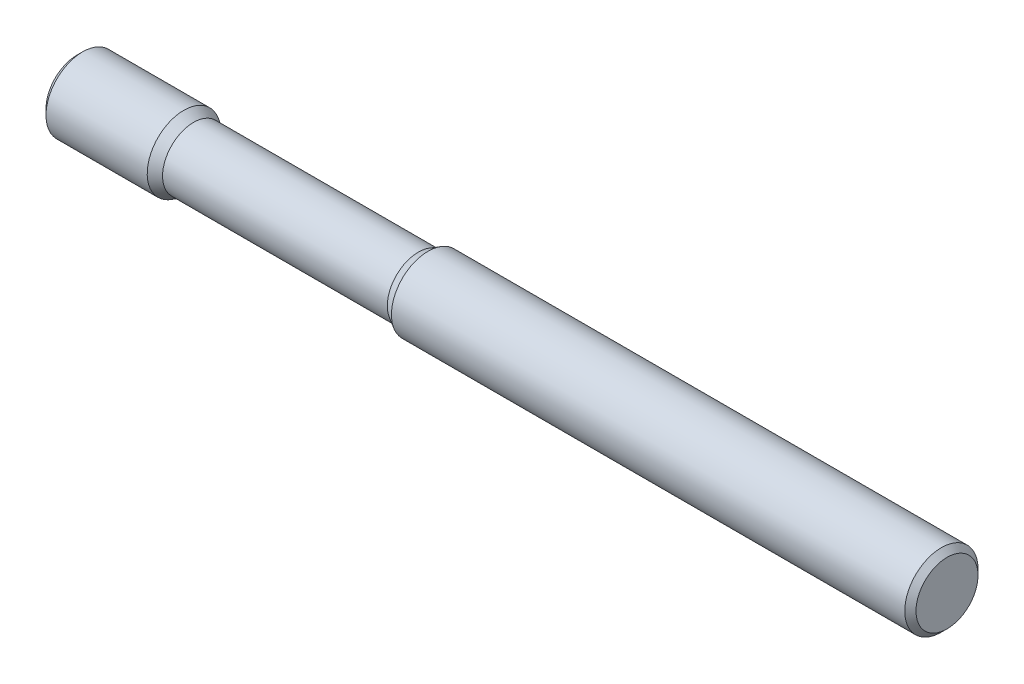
ISO-10303-21;
HEADER;
FILE_DESCRIPTION(('STEP AP214'),'2;1');
FILE_NAME('part.step','',(''),(''),'','','');
FILE_SCHEMA(('AUTOMOTIVE_DESIGN { 1 0 10303 214 1 1 1 1 }'));
ENDSEC;
DATA;
#1=APPLICATION_CONTEXT('core data for automotive mechanical design processes');
#2=APPLICATION_PROTOCOL_DEFINITION('international standard','automotive_design',2000,#1);
#3=PRODUCT_CONTEXT('',#1,'mechanical');
#4=PRODUCT('Part','Part','',(#3));
#5=PRODUCT_RELATED_PRODUCT_CATEGORY('part','',(#4));
#6=PRODUCT_DEFINITION_FORMATION('','',#4);
#7=PRODUCT_DEFINITION_CONTEXT('part definition',#1,'design');
#8=PRODUCT_DEFINITION('design','',#6,#7);
#9=PRODUCT_DEFINITION_SHAPE('','',#8);
#10=(LENGTH_UNIT() NAMED_UNIT(*) SI_UNIT(.MILLI.,.METRE.));
#11=(NAMED_UNIT(*) PLANE_ANGLE_UNIT() SI_UNIT($,.RADIAN.));
#12=(NAMED_UNIT(*) SI_UNIT($,.STERADIAN.) SOLID_ANGLE_UNIT());
#13=UNCERTAINTY_MEASURE_WITH_UNIT(LENGTH_MEASURE(1.E-05),#10,'distance_accuracy_value','');
#14=(GEOMETRIC_REPRESENTATION_CONTEXT(3) GLOBAL_UNCERTAINTY_ASSIGNED_CONTEXT((#13)) GLOBAL_UNIT_ASSIGNED_CONTEXT((#10,
#11,#12)) REPRESENTATION_CONTEXT('',''));
#15=CARTESIAN_POINT('',(0.,0.,0.));
#16=DIRECTION('',(0.,0.,1.));
#17=DIRECTION('',(1.,0.,0.));
#18=AXIS2_PLACEMENT_3D('',#15,#16,#17);
#19=CARTESIAN_POINT('',(0.,0.,0.));
#20=DIRECTION('',(-1.,0.,0.));
#21=DIRECTION('',(0.,-1.,0.));
#22=AXIS2_PLACEMENT_3D('',#19,#20,#21);
#23=PLANE('',#22);
#24=CARTESIAN_POINT('',(0.,0.,0.));
#25=DIRECTION('',(1.,0.,0.));
#26=DIRECTION('',(0.,1.,0.));
#27=AXIS2_PLACEMENT_3D('',#24,#25,#26);
#28=CIRCLE('',#27,10.159695);
#29=CARTESIAN_POINT('',(0.,10.159695,0.));
#30=VERTEX_POINT('',#29);
#31=EDGE_CURVE('E10',#30,#30,#28,.T.);
#32=ORIENTED_EDGE('',*,*,#31,.F.);
#33=EDGE_LOOP('',(#32));
#34=FACE_BOUND('',#33,.T.);
#35=ADVANCED_FACE('F35',(#34),#23,.T.);
#36=CARTESIAN_POINT('',(1.84030499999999,0.,0.));
#37=DIRECTION('',(1.,0.,0.));
#38=DIRECTION('',(0.,1.,0.));
#39=AXIS2_PLACEMENT_3D('',#36,#37,#38);
#40=CONICAL_SURFACE('',#39,12.,0.785398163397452);
#41=ORIENTED_EDGE('',*,*,#31,.T.);
#42=EDGE_LOOP('',(#41));
#43=FACE_BOUND('',#42,.T.);
#44=CARTESIAN_POINT('',(1.84030499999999,0.,0.));
#45=DIRECTION('',(1.,0.,0.));
#46=DIRECTION('',(0.,1.,0.));
#47=AXIS2_PLACEMENT_3D('',#44,#45,#46);
#48=CIRCLE('',#47,12.);
#49=CARTESIAN_POINT('',(1.84030499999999,12.,0.));
#50=VERTEX_POINT('',#49);
#51=EDGE_CURVE('E41',#50,#50,#48,.T.);
#52=ORIENTED_EDGE('',*,*,#51,.F.);
#53=EDGE_LOOP('',(#52));
#54=FACE_BOUND('',#53,.T.);
#55=ADVANCED_FACE('F83',(#43,#54),#40,.T.);
#56=CARTESIAN_POINT('',(285.,0.,0.));
#57=DIRECTION('',(1.,0.,0.));
#58=DIRECTION('',(0.,1.,0.));
#59=AXIS2_PLACEMENT_3D('',#56,#57,#58);
#60=CYLINDRICAL_SURFACE('',#59,12.);
#61=ORIENTED_EDGE('',*,*,#51,.T.);
#62=EDGE_LOOP('',(#61));
#63=FACE_BOUND('',#62,.T.);
#64=CARTESIAN_POINT('',(35.,0.,0.));
#65=DIRECTION('',(1.,0.,0.));
#66=DIRECTION('',(0.,1.,0.));
#67=AXIS2_PLACEMENT_3D('',#64,#65,#66);
#68=CIRCLE('',#67,12.);
#69=CARTESIAN_POINT('',(35.,12.,0.));
#70=VERTEX_POINT('',#69);
#71=EDGE_CURVE('E45',#70,#70,#68,.T.);
#72=ORIENTED_EDGE('',*,*,#71,.F.);
#73=EDGE_LOOP('',(#72));
#74=FACE_BOUND('',#73,.T.);
#75=ADVANCED_FACE('F88',(#63,#74),#60,.T.);
#76=CARTESIAN_POINT('',(38.1875017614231,0.,0.));
#77=DIRECTION('',(-1.,0.,0.));
#78=DIRECTION('',(0.,-1.,0.));
#79=AXIS2_PLACEMENT_3D('',#76,#77,#78);
#80=CONICAL_SURFACE('',#79,10.159695,0.523598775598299);
#81=ORIENTED_EDGE('',*,*,#71,.T.);
#82=EDGE_LOOP('',(#81));
#83=FACE_BOUND('',#82,.T.);
#84=CARTESIAN_POINT('',(38.1875017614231,0.,0.));
#85=DIRECTION('',(1.,0.,0.));
#86=DIRECTION('',(0.,1.,0.));
#87=AXIS2_PLACEMENT_3D('',#84,#85,#86);
#88=CIRCLE('',#87,10.159695);
#89=CARTESIAN_POINT('',(38.1875017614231,10.159695,0.));
#90=VERTEX_POINT('',#89);
#91=EDGE_CURVE('E49',#90,#90,#88,.T.);
#92=ORIENTED_EDGE('',*,*,#91,.F.);
#93=EDGE_LOOP('',(#92));
#94=FACE_BOUND('',#93,.T.);
#95=ADVANCED_FACE('F92',(#83,#94),#80,.T.);
#96=CARTESIAN_POINT('',(285.,0.,0.));
#97=DIRECTION('',(1.,0.,0.));
#98=DIRECTION('',(0.,1.,0.));
#99=AXIS2_PLACEMENT_3D('',#96,#97,#98);
#100=CYLINDRICAL_SURFACE('',#99,10.159695);
#101=ORIENTED_EDGE('',*,*,#91,.T.);
#102=EDGE_LOOP('',(#101));
#103=FACE_BOUND('',#102,.T.);
#104=CARTESIAN_POINT('',(111.812498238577,0.,0.));
#105=DIRECTION('',(1.,0.,0.));
#106=DIRECTION('',(0.,1.,0.));
#107=AXIS2_PLACEMENT_3D('',#104,#105,#106);
#108=CIRCLE('',#107,10.159695);
#109=CARTESIAN_POINT('',(111.812498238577,10.159695,0.));
#110=VERTEX_POINT('',#109);
#111=EDGE_CURVE('E54',#110,#110,#108,.T.);
#112=ORIENTED_EDGE('',*,*,#111,.F.);
#113=EDGE_LOOP('',(#112));
#114=FACE_BOUND('',#113,.T.);
#115=ADVANCED_FACE('F98',(#103,#114),#100,.T.);
#116=CARTESIAN_POINT('',(115.,0.,0.));
#117=DIRECTION('',(1.,0.,0.));
#118=DIRECTION('',(0.,1.,0.));
#119=AXIS2_PLACEMENT_3D('',#116,#117,#118);
#120=CONICAL_SURFACE('',#119,12.,0.523598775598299);
#121=ORIENTED_EDGE('',*,*,#111,.T.);
#122=EDGE_LOOP('',(#121));
#123=FACE_BOUND('',#122,.T.);
#124=CARTESIAN_POINT('',(115.,0.,0.));
#125=DIRECTION('',(1.,0.,0.));
#126=DIRECTION('',(0.,1.,0.));
#127=AXIS2_PLACEMENT_3D('',#124,#125,#126);
#128=CIRCLE('',#127,12.);
#129=CARTESIAN_POINT('',(115.,12.,0.));
#130=VERTEX_POINT('',#129);
#131=EDGE_CURVE('E57',#130,#130,#128,.T.);
#132=ORIENTED_EDGE('',*,*,#131,.F.);
#133=EDGE_LOOP('',(#132));
#134=FACE_BOUND('',#133,.T.);
#135=ADVANCED_FACE('F79',(#123,#134),#120,.T.);
#136=CARTESIAN_POINT('',(285.,0.,0.));
#137=DIRECTION('',(1.,0.,0.));
#138=DIRECTION('',(0.,1.,0.));
#139=AXIS2_PLACEMENT_3D('',#136,#137,#138);
#140=CYLINDRICAL_SURFACE('',#139,12.);
#141=ORIENTED_EDGE('',*,*,#131,.T.);
#142=EDGE_LOOP('',(#141));
#143=FACE_BOUND('',#142,.T.);
#144=CARTESIAN_POINT('',(283.159695,0.,0.));
#145=DIRECTION('',(1.,0.,0.));
#146=DIRECTION('',(0.,1.,0.));
#147=AXIS2_PLACEMENT_3D('',#144,#145,#146);
#148=CIRCLE('',#147,12.);
#149=CARTESIAN_POINT('',(283.159695,12.,0.));
#150=VERTEX_POINT('',#149);
#151=EDGE_CURVE('E60',#150,#150,#148,.T.);
#152=ORIENTED_EDGE('',*,*,#151,.F.);
#153=EDGE_LOOP('',(#152));
#154=FACE_BOUND('',#153,.T.);
#155=ADVANCED_FACE('F71',(#143,#154),#140,.T.);
#156=CARTESIAN_POINT('',(285.,0.,0.));
#157=DIRECTION('',(-1.,0.,0.));
#158=DIRECTION('',(0.,-1.,0.));
#159=AXIS2_PLACEMENT_3D('',#156,#157,#158);
#160=CONICAL_SURFACE('',#159,10.159695,0.785398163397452);
#161=ORIENTED_EDGE('',*,*,#151,.T.);
#162=EDGE_LOOP('',(#161));
#163=FACE_BOUND('',#162,.T.);
#164=CARTESIAN_POINT('',(285.,0.,0.));
#165=DIRECTION('',(1.,0.,0.));
#166=DIRECTION('',(0.,1.,0.));
#167=AXIS2_PLACEMENT_3D('',#164,#165,#166);
#168=CIRCLE('',#167,10.159695);
#169=CARTESIAN_POINT('',(285.,10.159695,0.));
#170=VERTEX_POINT('',#169);
#171=EDGE_CURVE('E63',#170,#170,#168,.T.);
#172=ORIENTED_EDGE('',*,*,#171,.F.);
#173=EDGE_LOOP('',(#172));
#174=FACE_BOUND('',#173,.T.);
#175=ADVANCED_FACE('F69',(#163,#174),#160,.T.);
#176=CARTESIAN_POINT('',(285.,10.159695,0.));
#177=DIRECTION('',(1.,0.,0.));
#178=DIRECTION('',(0.,1.,0.));
#179=AXIS2_PLACEMENT_3D('',#176,#177,#178);
#180=PLANE('',#179);
#181=ORIENTED_EDGE('',*,*,#171,.T.);
#182=EDGE_LOOP('',(#181));
#183=FACE_BOUND('',#182,.T.);
#184=ADVANCED_FACE('F67',(#183),#180,.T.);
#185=CLOSED_SHELL('',(#35,#55,#75,#95,#115,#135,#155,#175,#184));
#186=MANIFOLD_SOLID_BREP('B2',#185);
#187=ADVANCED_BREP_SHAPE_REPRESENTATION('',(#18,#186),#14);
#188=SHAPE_DEFINITION_REPRESENTATION(#9,#187);
ENDSEC;
END-ISO-10303-21;
